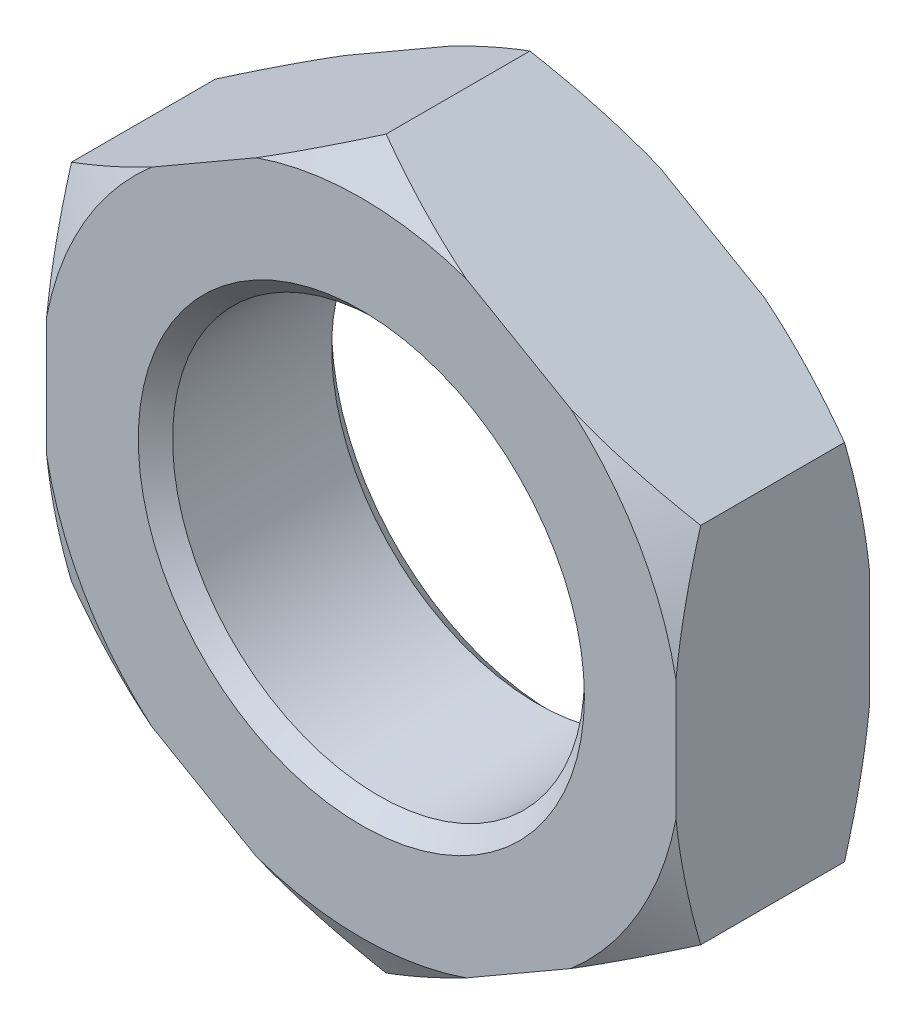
from build123d import *

# Parameters (mm, degrees)
BOSS_EXTRUDE1_DEPTH = 8.45
SKETCH6_R           = 18
CUT_EXTRUDE1_DEPTH  = 16.9
CHAMFER1_SIZE       = 1.5


with BuildPart() as part:
    # Sketch3 → Boss-Extrude1 (new, symmetric)
    with BuildSketch(Plane.XY):
        Polygon((0, 31.754264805), (-27.5, 15.877132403), (-27.5, -15.877132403), (0, -31.754264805), (27.5, -15.877132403), (27.5, 15.877132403), align=None)
    extrude(amount=BOSS_EXTRUDE1_DEPTH, both=True)

    # Sketch5 → Cut-Revolve1 (revolve, cut)
    with BuildSketch(Plane(origin=(0, 0, 0), x_dir=(0, 0, -1), z_dir=(1, 0, 0))):
        Polygon((-8.45, 31.754264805), (-8.45, 28.004264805), (-6.284936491, 31.754264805), align=None)
    cut_revolve1 = revolve(axis=Axis((0, 0, 5.457798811), (0, 0, -1)), mode=Mode.SUBTRACT)

    # Mirror1: Cut-Revolve1 across plane
    add(cut_revolve1.mirror(Plane.XY), mode=Mode.SUBTRACT)

    # Sketch6 → Cut-Extrude1 (cut)
    with BuildSketch(Plane.XY.offset(8.45)):
        Circle(SKETCH6_R)
    extrude(amount=-CUT_EXTRUDE1_DEPTH, mode=Mode.SUBTRACT)

    # Chamfer1
    chamfer1_edges = [part.edges().sort_by_distance(p)[0] for p in [
        (-18, 0, -8.45),
        (-18, 0, 8.45),
    ]]
    chamfer(chamfer1_edges, length=CHAMFER1_SIZE)


solid = part.part
